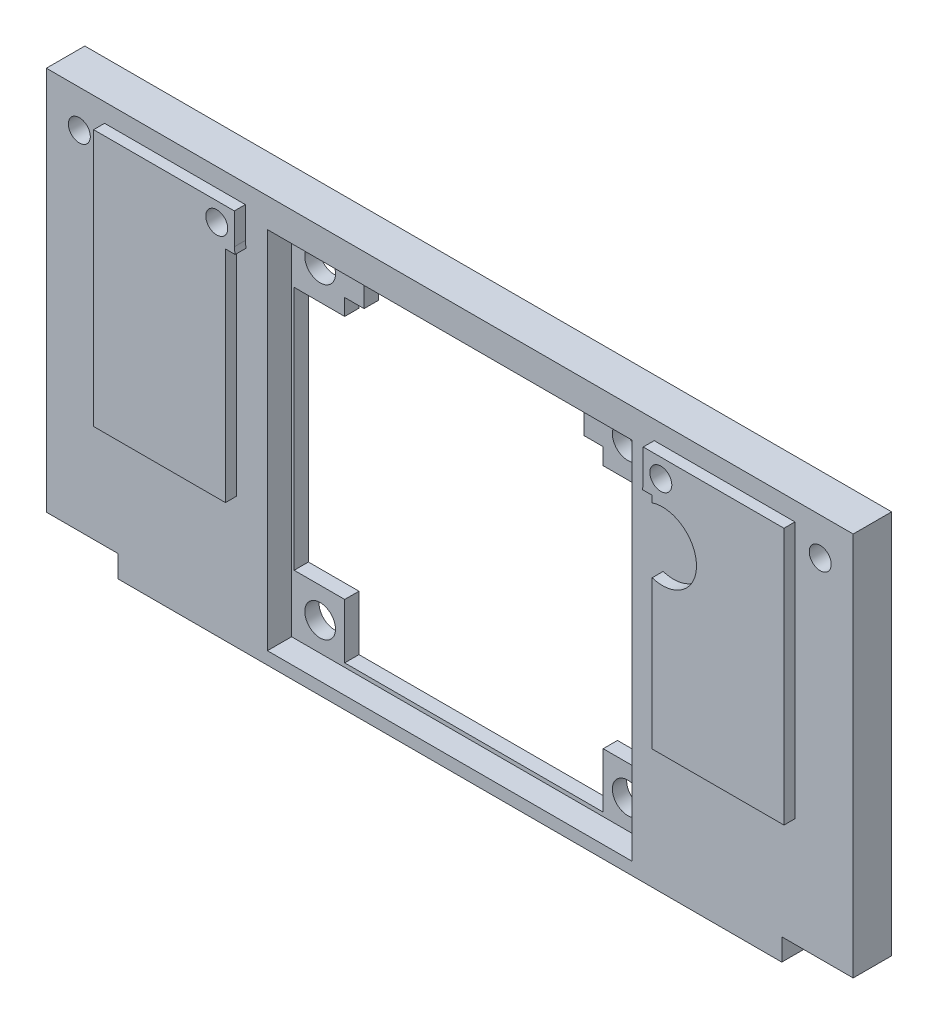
from build123d import *

# Parameters (mm, degrees)
SKETCH3_R           = 1.4
SKETCH3_R_2         = 1
BOSS_EXTRUDE1_DEPTH = 3.5
SKETCH9_W           = 33.2
SKETCH9_H           = 33.2
CUT_EXTRUDE1_DEPTH  = 2.2
SKETCH10_W          = 20
SKETCH10_H          = 2.5
CUT_EXTRUDE2_DEPTH  = 1.75
SKETCH11_R          = 1
BOSS_EXTRUDE2_DEPTH = 1
SKETCH14_R          = 3.1
CUT_EXTRUDE3_DEPTH  = 1
SKETCH15_W          = 6.5
SKETCH15_H          = 2
CUT_EXTRUDE4_DEPTH  = 54.906325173


with BuildPart() as part:
    # Sketch3 → Boss-Extrude1 (new body)
    with BuildSketch(Plane.XY):
        Polygon((-39.936821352, -0.962627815), (-39.936821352, 36.037372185), (33.503178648, 36.037372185), (33.503178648, -0.962627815), (7.298178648, -0.962627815), (-14.831821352, -0.962627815), align=None)
        with Locations((-17.216821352, 30.777902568)):
            Circle(SKETCH3_R, mode=Mode.SUBTRACT)
        with Locations((-36.936821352, 32.642902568)):
            Circle(SKETCH3_R_2, mode=Mode.SUBTRACT)
        with Locations((-23.426821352, 32.642902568)):
            Circle(SKETCH3_R_2, mode=Mode.SUBTRACT)
        with Locations((16.993178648, 32.642902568)):
            Circle(SKETCH3_R_2, mode=Mode.SUBTRACT)
        with Locations((30.503178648, 32.642902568)):
            Circle(SKETCH3_R_2, mode=Mode.SUBTRACT)
        with Locations((-17.216821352, 2.777902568)):
            Circle(SKETCH3_R, mode=Mode.SUBTRACT)
        with Locations((10.783178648, 30.777902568)):
            Circle(SKETCH3_R, mode=Mode.SUBTRACT)
        with Locations((10.783178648, 2.777902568)):
            Circle(SKETCH3_R, mode=Mode.SUBTRACT)
        Polygon((-14.981821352, 0.537372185), (-14.981821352, 5.537372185), (-19.581821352, 5.537372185), (-19.581821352, 27.842902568), (-14.981821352, 27.842902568), (-14.981821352, 29.342902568), (8.548178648, 29.342902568), (8.548178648, 27.842902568), (13.148178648, 27.842902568), (13.148178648, 5.537372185), (8.548178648, 5.537372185), (8.548178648, 0.537372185), align=None, mode=Mode.SUBTRACT)
    extrude(amount=BOSS_EXTRUDE1_DEPTH)

    # Sketch9 → Cut-Extrude1 (cut)
    with BuildSketch(Plane(origin=(0, 0, 3.5), x_dir=(-1, 0, 0), z_dir=(0, 0, -1))):
        with Locations((3.216821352, 16.777902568)):
            Rectangle(SKETCH9_W, SKETCH9_H)
    extrude(amount=CUT_EXTRUDE1_DEPTH, mode=Mode.SUBTRACT)

    # Sketch10 → Cut-Extrude2 (cut)
    with BuildSketch(Plane(origin=(0, 0, 0), x_dir=(-1, 0, 0), z_dir=(0, 0, -1))):
        with Locations((3.216821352, 30.592902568)):
            Rectangle(SKETCH10_W, SKETCH10_H)
    extrude(amount=-CUT_EXTRUDE2_DEPTH, mode=Mode.SUBTRACT)

    # Sketch11 → Boss-Extrude2 (add)
    with BuildSketch(Plane.XY.offset(3.5)):
        with BuildLine():
            Line((-34.636821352, 30.942902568), (-34.636821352, 10.942902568))
            Line((-34.636821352, 10.942902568), (-22.636821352, 10.942902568))
            Line((-22.636821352, 10.942902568), (-22.636821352, 30.942902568))
            Line((-22.636821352, 30.942902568), (-21.751928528, 30.942902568))
            ThreePointArc((-21.751928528, 30.942902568), (-21.800520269, 31.226847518), (-21.826821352, 31.513717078))
            Line((-21.826821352, 31.513717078), (-21.826821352, 34.342902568))
            Line((-21.826821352, 34.342902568), (-34.636821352, 34.342902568))
            Line((-34.636821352, 34.342902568), (-34.636821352, 30.942902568))
        make_face()
        with Locations((-23.426821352, 32.642902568)):
            Circle(SKETCH11_R, mode=Mode.SUBTRACT)
    boss_extrude2 = extrude(amount=BOSS_EXTRUDE2_DEPTH)

    # Mirror1: Boss-Extrude2 across plane
    add(boss_extrude2.mirror(Plane.ZY.offset(3.216821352)))

    # Sketch14 → Cut-Extrude3 (cut)
    with BuildSketch(Plane.XY.offset(4.5)):
        with Locations((17.142214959, 27.392343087)):
            Circle(SKETCH14_R)
    extrude(amount=-CUT_EXTRUDE3_DEPTH, mode=Mode.SUBTRACT)

    # Sketch15 → Cut-Extrude4 (cut, through all)
    with BuildSketch(Plane.XY.offset(3.5)):
        with Locations((-36.686821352, 0.037372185)):
            Rectangle(SKETCH15_W, SKETCH15_H)
        with Locations((30.253178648, 0.037372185)):
            Rectangle(SKETCH15_W, SKETCH15_H)
    extrude(amount=-CUT_EXTRUDE4_DEPTH, mode=Mode.SUBTRACT)


solid = part.part
